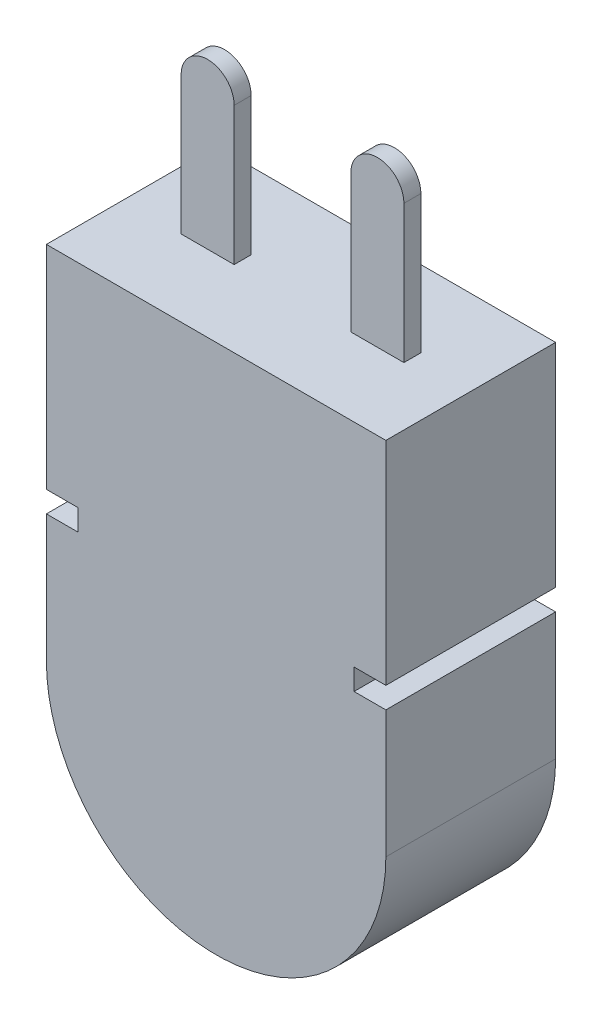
ISO-10303-21;
HEADER;
FILE_DESCRIPTION(('STEP AP214'),'2;1');
FILE_NAME('part.step','',(''),(''),'','','');
FILE_SCHEMA(('AUTOMOTIVE_DESIGN { 1 0 10303 214 1 1 1 1 }'));
ENDSEC;
DATA;
#1=APPLICATION_CONTEXT('core data for automotive mechanical design processes');
#2=APPLICATION_PROTOCOL_DEFINITION('international standard','automotive_design',2000,#1);
#3=PRODUCT_CONTEXT('',#1,'mechanical');
#4=PRODUCT('Part','Part','',(#3));
#5=PRODUCT_RELATED_PRODUCT_CATEGORY('part','',(#4));
#6=PRODUCT_DEFINITION_FORMATION('','',#4);
#7=PRODUCT_DEFINITION_CONTEXT('part definition',#1,'design');
#8=PRODUCT_DEFINITION('design','',#6,#7);
#9=PRODUCT_DEFINITION_SHAPE('','',#8);
#10=(LENGTH_UNIT() NAMED_UNIT(*) SI_UNIT(.MILLI.,.METRE.));
#11=(NAMED_UNIT(*) PLANE_ANGLE_UNIT() SI_UNIT($,.RADIAN.));
#12=(NAMED_UNIT(*) SI_UNIT($,.STERADIAN.) SOLID_ANGLE_UNIT());
#13=UNCERTAINTY_MEASURE_WITH_UNIT(LENGTH_MEASURE(1.E-05),#10,'distance_accuracy_value','');
#14=(GEOMETRIC_REPRESENTATION_CONTEXT(3) GLOBAL_UNCERTAINTY_ASSIGNED_CONTEXT((#13)) GLOBAL_UNIT_ASSIGNED_CONTEXT((#10,
#11,#12)) REPRESENTATION_CONTEXT('',''));
#15=CARTESIAN_POINT('',(0.,0.,0.));
#16=DIRECTION('',(0.,0.,1.));
#17=DIRECTION('',(1.,0.,0.));
#18=AXIS2_PLACEMENT_3D('',#15,#16,#17);
#19=CARTESIAN_POINT('',(-8.,0.,4.));
#20=DIRECTION('',(0.,-1.,0.));
#21=DIRECTION('',(0.,0.,-1.));
#22=AXIS2_PLACEMENT_3D('',#19,#20,#21);
#23=PLANE('',#22);
#24=DIRECTION('',(-1.,0.,0.));
#25=VECTOR('',#24,1.);
#26=CARTESIAN_POINT('',(-8.,0.,-4.));
#27=LINE('',#26,#25);
#28=CARTESIAN_POINT('',(8.,0.,-4.));
#29=VERTEX_POINT('',#28);
#30=CARTESIAN_POINT('',(-8.,0.,-4.));
#31=VERTEX_POINT('',#30);
#32=EDGE_CURVE('E215',#29,#31,#27,.T.);
#33=ORIENTED_EDGE('',*,*,#32,.T.);
#34=DIRECTION('',(0.,0.,-1.));
#35=VECTOR('',#34,1.);
#36=CARTESIAN_POINT('',(-8.,0.,4.));
#37=LINE('',#36,#35);
#38=CARTESIAN_POINT('',(-8.,0.,4.));
#39=VERTEX_POINT('',#38);
#40=EDGE_CURVE('E58',#39,#31,#37,.T.);
#41=ORIENTED_EDGE('',*,*,#40,.F.);
#42=DIRECTION('',(-1.,0.,0.));
#43=VECTOR('',#42,1.);
#44=CARTESIAN_POINT('',(-8.,0.,4.));
#45=LINE('',#44,#43);
#46=CARTESIAN_POINT('',(8.,0.,4.));
#47=VERTEX_POINT('',#46);
#48=EDGE_CURVE('E265',#47,#39,#45,.T.);
#49=ORIENTED_EDGE('',*,*,#48,.F.);
#50=DIRECTION('',(0.,0.,-1.));
#51=VECTOR('',#50,1.);
#52=CARTESIAN_POINT('',(8.,0.,4.));
#53=LINE('',#52,#51);
#54=EDGE_CURVE('E11',#47,#29,#53,.T.);
#55=ORIENTED_EDGE('',*,*,#54,.T.);
#56=EDGE_LOOP('',(#33,#41,#49,#55));
#57=FACE_BOUND('',#56,.T.);
#58=DIRECTION('',(0.,0.,-1.));
#59=VECTOR('',#58,1.);
#60=CARTESIAN_POINT('',(5.25,0.,0.4));
#61=LINE('',#60,#59);
#62=CARTESIAN_POINT('',(5.25,0.,0.4));
#63=VERTEX_POINT('',#62);
#64=CARTESIAN_POINT('',(5.25,0.,-0.4));
#65=VERTEX_POINT('',#64);
#66=EDGE_CURVE('E73',#63,#65,#61,.T.);
#67=ORIENTED_EDGE('',*,*,#66,.F.);
#68=DIRECTION('',(1.,0.,0.));
#69=VECTOR('',#68,1.);
#70=CARTESIAN_POINT('',(5.25,0.,0.4));
#71=LINE('',#70,#69);
#72=CARTESIAN_POINT('',(2.75,0.,0.4));
#73=VERTEX_POINT('',#72);
#74=EDGE_CURVE('E240',#73,#63,#71,.T.);
#75=ORIENTED_EDGE('',*,*,#74,.F.);
#76=DIRECTION('',(0.,0.,-1.));
#77=VECTOR('',#76,1.);
#78=CARTESIAN_POINT('',(2.75,0.,0.4));
#79=LINE('',#78,#77);
#80=CARTESIAN_POINT('',(2.75,0.,-0.4));
#81=VERTEX_POINT('',#80);
#82=EDGE_CURVE('E231',#73,#81,#79,.T.);
#83=ORIENTED_EDGE('',*,*,#82,.T.);
#84=DIRECTION('',(1.,0.,0.));
#85=VECTOR('',#84,1.);
#86=CARTESIAN_POINT('',(5.25,0.,-0.4));
#87=LINE('',#86,#85);
#88=EDGE_CURVE('E246',#81,#65,#87,.T.);
#89=ORIENTED_EDGE('',*,*,#88,.T.);
#90=EDGE_LOOP('',(#67,#75,#83,#89));
#91=FACE_BOUND('',#90,.T.);
#92=DIRECTION('',(1.,0.,0.));
#93=VECTOR('',#92,1.);
#94=CARTESIAN_POINT('',(-5.25,0.,0.4));
#95=LINE('',#94,#93);
#96=CARTESIAN_POINT('',(-5.25,0.,0.4));
#97=VERTEX_POINT('',#96);
#98=CARTESIAN_POINT('',(-2.75,0.,0.4));
#99=VERTEX_POINT('',#98);
#100=EDGE_CURVE('E194',#97,#99,#95,.T.);
#101=ORIENTED_EDGE('',*,*,#100,.F.);
#102=DIRECTION('',(0.,0.,-1.));
#103=VECTOR('',#102,1.);
#104=CARTESIAN_POINT('',(-5.25,0.,0.4));
#105=LINE('',#104,#103);
#106=CARTESIAN_POINT('',(-5.25,0.,-0.4));
#107=VERTEX_POINT('',#106);
#108=EDGE_CURVE('E636',#97,#107,#105,.T.);
#109=ORIENTED_EDGE('',*,*,#108,.T.);
#110=DIRECTION('',(1.,0.,0.));
#111=VECTOR('',#110,1.);
#112=CARTESIAN_POINT('',(-5.25,0.,-0.4));
#113=LINE('',#112,#111);
#114=CARTESIAN_POINT('',(-2.75,0.,-0.4));
#115=VERTEX_POINT('',#114);
#116=EDGE_CURVE('E208',#107,#115,#113,.T.);
#117=ORIENTED_EDGE('',*,*,#116,.T.);
#118=DIRECTION('',(0.,0.,-1.));
#119=VECTOR('',#118,1.);
#120=CARTESIAN_POINT('',(-2.75,0.,0.4));
#121=LINE('',#120,#119);
#122=EDGE_CURVE('E65',#99,#115,#121,.T.);
#123=ORIENTED_EDGE('',*,*,#122,.F.);
#124=EDGE_LOOP('',(#101,#109,#117,#123));
#125=FACE_BOUND('',#124,.T.);
#126=ADVANCED_FACE('F49',(#57,#91,#125),#23,.F.);
#127=CARTESIAN_POINT('',(8.,0.,4.));
#128=DIRECTION('',(-1.,0.,0.));
#129=DIRECTION('',(0.,0.,1.));
#130=AXIS2_PLACEMENT_3D('',#127,#128,#129);
#131=PLANE('',#130);
#132=DIRECTION('',(0.,1.,0.));
#133=VECTOR('',#132,1.);
#134=CARTESIAN_POINT('',(8.,0.,-4.));
#135=LINE('',#134,#133);
#136=CARTESIAN_POINT('',(8.,-10.,-4.));
#137=VERTEX_POINT('',#136);
#138=EDGE_CURVE('E210',#137,#29,#135,.T.);
#139=ORIENTED_EDGE('',*,*,#138,.T.);
#140=ORIENTED_EDGE('',*,*,#54,.F.);
#141=DIRECTION('',(0.,1.,0.));
#142=VECTOR('',#141,1.);
#143=CARTESIAN_POINT('',(8.,0.,4.));
#144=LINE('',#143,#142);
#145=CARTESIAN_POINT('',(8.,-10.,4.));
#146=VERTEX_POINT('',#145);
#147=EDGE_CURVE('E261',#146,#47,#144,.T.);
#148=ORIENTED_EDGE('',*,*,#147,.F.);
#149=DIRECTION('',(0.,0.,-1.));
#150=VECTOR('',#149,1.);
#151=CARTESIAN_POINT('',(8.,-10.,4.));
#152=LINE('',#151,#150);
#153=EDGE_CURVE('E298',#146,#137,#152,.T.);
#154=ORIENTED_EDGE('',*,*,#153,.T.);
#155=EDGE_LOOP('',(#139,#140,#148,#154));
#156=FACE_BOUND('',#155,.T.);
#157=ADVANCED_FACE('F51',(#156),#131,.F.);
#158=CARTESIAN_POINT('',(-8.,-10.,4.));
#159=DIRECTION('',(1.,0.,0.));
#160=DIRECTION('',(0.,0.,-1.));
#161=AXIS2_PLACEMENT_3D('',#158,#159,#160);
#162=PLANE('',#161);
#163=DIRECTION('',(0.,-1.,0.));
#164=VECTOR('',#163,1.);
#165=CARTESIAN_POINT('',(-8.,-10.,-4.));
#166=LINE('',#165,#164);
#167=CARTESIAN_POINT('',(-8.,-10.,-4.));
#168=VERTEX_POINT('',#167);
#169=EDGE_CURVE('E302',#31,#168,#166,.T.);
#170=ORIENTED_EDGE('',*,*,#169,.T.);
#171=DIRECTION('',(0.,0.,-1.));
#172=VECTOR('',#171,1.);
#173=CARTESIAN_POINT('',(-8.,-10.,4.));
#174=LINE('',#173,#172);
#175=CARTESIAN_POINT('',(-8.,-10.,4.));
#176=VERTEX_POINT('',#175);
#177=EDGE_CURVE('E366',#176,#168,#174,.T.);
#178=ORIENTED_EDGE('',*,*,#177,.F.);
#179=DIRECTION('',(0.,-1.,0.));
#180=VECTOR('',#179,1.);
#181=CARTESIAN_POINT('',(-8.,-10.,4.));
#182=LINE('',#181,#180);
#183=EDGE_CURVE('E269',#39,#176,#182,.T.);
#184=ORIENTED_EDGE('',*,*,#183,.F.);
#185=ORIENTED_EDGE('',*,*,#40,.T.);
#186=EDGE_LOOP('',(#170,#178,#184,#185));
#187=FACE_BOUND('',#186,.T.);
#188=ADVANCED_FACE('F375',(#187),#162,.F.);
#189=CARTESIAN_POINT('',(-6.5,-10.,4.));
#190=DIRECTION('',(0.,1.,0.));
#191=DIRECTION('',(0.,0.,1.));
#192=AXIS2_PLACEMENT_3D('',#189,#190,#191);
#193=PLANE('',#192);
#194=DIRECTION('',(1.,0.,0.));
#195=VECTOR('',#194,1.);
#196=CARTESIAN_POINT('',(-6.5,-10.,-4.));
#197=LINE('',#196,#195);
#198=CARTESIAN_POINT('',(-6.5,-10.,-4.));
#199=VERTEX_POINT('',#198);
#200=EDGE_CURVE('E305',#168,#199,#197,.T.);
#201=ORIENTED_EDGE('',*,*,#200,.T.);
#202=DIRECTION('',(0.,0.,-1.));
#203=VECTOR('',#202,1.);
#204=CARTESIAN_POINT('',(-6.5,-10.,4.));
#205=LINE('',#204,#203);
#206=CARTESIAN_POINT('',(-6.5,-10.,4.));
#207=VERTEX_POINT('',#206);
#208=EDGE_CURVE('E362',#207,#199,#205,.T.);
#209=ORIENTED_EDGE('',*,*,#208,.F.);
#210=DIRECTION('',(1.,0.,0.));
#211=VECTOR('',#210,1.);
#212=CARTESIAN_POINT('',(-6.5,-10.,4.));
#213=LINE('',#212,#211);
#214=EDGE_CURVE('E272',#176,#207,#213,.T.);
#215=ORIENTED_EDGE('',*,*,#214,.F.);
#216=ORIENTED_EDGE('',*,*,#177,.T.);
#217=EDGE_LOOP('',(#201,#209,#215,#216));
#218=FACE_BOUND('',#217,.T.);
#219=ADVANCED_FACE('F386',(#218),#193,.F.);
#220=CARTESIAN_POINT('',(-6.5,-11.,4.));
#221=DIRECTION('',(1.,0.,0.));
#222=DIRECTION('',(0.,1.,0.));
#223=AXIS2_PLACEMENT_3D('',#220,#221,#222);
#224=PLANE('',#223);
#225=DIRECTION('',(0.,-1.,0.));
#226=VECTOR('',#225,1.);
#227=CARTESIAN_POINT('',(-6.5,-11.,-4.));
#228=LINE('',#227,#226);
#229=CARTESIAN_POINT('',(-6.5,-11.,-4.));
#230=VERTEX_POINT('',#229);
#231=EDGE_CURVE('E308',#199,#230,#228,.T.);
#232=ORIENTED_EDGE('',*,*,#231,.T.);
#233=DIRECTION('',(0.,0.,-1.));
#234=VECTOR('',#233,1.);
#235=CARTESIAN_POINT('',(-6.5,-11.,4.));
#236=LINE('',#235,#234);
#237=CARTESIAN_POINT('',(-6.5,-11.,4.));
#238=VERTEX_POINT('',#237);
#239=EDGE_CURVE('E358',#238,#230,#236,.T.);
#240=ORIENTED_EDGE('',*,*,#239,.F.);
#241=DIRECTION('',(0.,-1.,0.));
#242=VECTOR('',#241,1.);
#243=CARTESIAN_POINT('',(-6.5,-11.,4.));
#244=LINE('',#243,#242);
#245=EDGE_CURVE('E275',#207,#238,#244,.T.);
#246=ORIENTED_EDGE('',*,*,#245,.F.);
#247=ORIENTED_EDGE('',*,*,#208,.T.);
#248=EDGE_LOOP('',(#232,#240,#246,#247));
#249=FACE_BOUND('',#248,.T.);
#250=ADVANCED_FACE('F390',(#249),#224,.F.);
#251=CARTESIAN_POINT('',(-8.,-11.,4.));
#252=DIRECTION('',(0.,-1.,0.));
#253=DIRECTION('',(0.,0.,-1.));
#254=AXIS2_PLACEMENT_3D('',#251,#252,#253);
#255=PLANE('',#254);
#256=DIRECTION('',(-1.,0.,0.));
#257=VECTOR('',#256,1.);
#258=CARTESIAN_POINT('',(-8.,-11.,-4.));
#259=LINE('',#258,#257);
#260=CARTESIAN_POINT('',(-8.,-11.,-4.));
#261=VERTEX_POINT('',#260);
#262=EDGE_CURVE('E311',#230,#261,#259,.T.);
#263=ORIENTED_EDGE('',*,*,#262,.T.);
#264=DIRECTION('',(0.,0.,-1.));
#265=VECTOR('',#264,1.);
#266=CARTESIAN_POINT('',(-8.,-11.,4.));
#267=LINE('',#266,#265);
#268=CARTESIAN_POINT('',(-8.,-11.,4.));
#269=VERTEX_POINT('',#268);
#270=EDGE_CURVE('E354',#269,#261,#267,.T.);
#271=ORIENTED_EDGE('',*,*,#270,.F.);
#272=DIRECTION('',(-1.,0.,0.));
#273=VECTOR('',#272,1.);
#274=CARTESIAN_POINT('',(-8.,-11.,4.));
#275=LINE('',#274,#273);
#276=EDGE_CURVE('E278',#238,#269,#275,.T.);
#277=ORIENTED_EDGE('',*,*,#276,.F.);
#278=ORIENTED_EDGE('',*,*,#239,.T.);
#279=EDGE_LOOP('',(#263,#271,#277,#278));
#280=FACE_BOUND('',#279,.T.);
#281=ADVANCED_FACE('F430',(#280),#255,.F.);
#282=CARTESIAN_POINT('',(-8.,-17.,4.));
#283=DIRECTION('',(1.,0.,0.));
#284=DIRECTION('',(0.,1.,0.));
#285=AXIS2_PLACEMENT_3D('',#282,#283,#284);
#286=PLANE('',#285);
#287=DIRECTION('',(0.,-1.,0.));
#288=VECTOR('',#287,1.);
#289=CARTESIAN_POINT('',(-8.,-17.,-4.));
#290=LINE('',#289,#288);
#291=CARTESIAN_POINT('',(-8.,-17.,-4.));
#292=VERTEX_POINT('',#291);
#293=EDGE_CURVE('E314',#261,#292,#290,.T.);
#294=ORIENTED_EDGE('',*,*,#293,.T.);
#295=DIRECTION('',(0.,0.,-1.));
#296=VECTOR('',#295,1.);
#297=CARTESIAN_POINT('',(-8.,-17.,4.));
#298=LINE('',#297,#296);
#299=CARTESIAN_POINT('',(-8.,-17.,4.));
#300=VERTEX_POINT('',#299);
#301=EDGE_CURVE('E350',#300,#292,#298,.T.);
#302=ORIENTED_EDGE('',*,*,#301,.F.);
#303=DIRECTION('',(0.,-1.,0.));
#304=VECTOR('',#303,1.);
#305=CARTESIAN_POINT('',(-8.,-17.,4.));
#306=LINE('',#305,#304);
#307=EDGE_CURVE('E281',#269,#300,#306,.T.);
#308=ORIENTED_EDGE('',*,*,#307,.F.);
#309=ORIENTED_EDGE('',*,*,#270,.T.);
#310=EDGE_LOOP('',(#294,#302,#308,#309));
#311=FACE_BOUND('',#310,.T.);
#312=ADVANCED_FACE('F428',(#311),#286,.F.);
#313=CARTESIAN_POINT('',(0.,-17.,4.));
#314=DIRECTION('',(0.,0.,-1.));
#315=DIRECTION('',(-1.,0.,0.));
#316=AXIS2_PLACEMENT_3D('',#313,#314,#315);
#317=CYLINDRICAL_SURFACE('',#316,8.);
#318=CARTESIAN_POINT('',(0.,-17.,-4.));
#319=DIRECTION('',(0.,0.,1.));
#320=DIRECTION('',(-1.,0.,0.));
#321=AXIS2_PLACEMENT_3D('',#318,#319,#320);
#322=CIRCLE('',#321,8.);
#323=CARTESIAN_POINT('',(8.,-17.,-4.));
#324=VERTEX_POINT('',#323);
#325=EDGE_CURVE('E317',#292,#324,#322,.T.);
#326=ORIENTED_EDGE('',*,*,#325,.T.);
#327=DIRECTION('',(0.,0.,-1.));
#328=VECTOR('',#327,1.);
#329=CARTESIAN_POINT('',(8.,-17.,4.));
#330=LINE('',#329,#328);
#331=CARTESIAN_POINT('',(8.,-17.,4.));
#332=VERTEX_POINT('',#331);
#333=EDGE_CURVE('E346',#332,#324,#330,.T.);
#334=ORIENTED_EDGE('',*,*,#333,.F.);
#335=CARTESIAN_POINT('',(0.,-17.,4.));
#336=DIRECTION('',(0.,0.,1.));
#337=DIRECTION('',(-1.,0.,0.));
#338=AXIS2_PLACEMENT_3D('',#335,#336,#337);
#339=CIRCLE('',#338,8.);
#340=EDGE_CURVE('E284',#300,#332,#339,.T.);
#341=ORIENTED_EDGE('',*,*,#340,.F.);
#342=ORIENTED_EDGE('',*,*,#301,.T.);
#343=EDGE_LOOP('',(#326,#334,#341,#342));
#344=FACE_BOUND('',#343,.T.);
#345=ADVANCED_FACE('F424',(#344),#317,.T.);
#346=CARTESIAN_POINT('',(8.,-11.,4.));
#347=DIRECTION('',(-1.,0.,0.));
#348=DIRECTION('',(0.,-1.,0.));
#349=AXIS2_PLACEMENT_3D('',#346,#347,#348);
#350=PLANE('',#349);
#351=DIRECTION('',(0.,1.,0.));
#352=VECTOR('',#351,1.);
#353=CARTESIAN_POINT('',(8.,-11.,-4.));
#354=LINE('',#353,#352);
#355=CARTESIAN_POINT('',(8.,-11.,-4.));
#356=VERTEX_POINT('',#355);
#357=EDGE_CURVE('E320',#324,#356,#354,.T.);
#358=ORIENTED_EDGE('',*,*,#357,.T.);
#359=DIRECTION('',(0.,0.,-1.));
#360=VECTOR('',#359,1.);
#361=CARTESIAN_POINT('',(8.,-11.,4.));
#362=LINE('',#361,#360);
#363=CARTESIAN_POINT('',(8.,-11.,4.));
#364=VERTEX_POINT('',#363);
#365=EDGE_CURVE('E342',#364,#356,#362,.T.);
#366=ORIENTED_EDGE('',*,*,#365,.F.);
#367=DIRECTION('',(0.,1.,0.));
#368=VECTOR('',#367,1.);
#369=CARTESIAN_POINT('',(8.,-11.,4.));
#370=LINE('',#369,#368);
#371=EDGE_CURVE('E287',#332,#364,#370,.T.);
#372=ORIENTED_EDGE('',*,*,#371,.F.);
#373=ORIENTED_EDGE('',*,*,#333,.T.);
#374=EDGE_LOOP('',(#358,#366,#372,#373));
#375=FACE_BOUND('',#374,.T.);
#376=ADVANCED_FACE('F419',(#375),#350,.F.);
#377=CARTESIAN_POINT('',(6.5,-11.,4.));
#378=DIRECTION('',(0.,-1.,0.));
#379=DIRECTION('',(0.,0.,-1.));
#380=AXIS2_PLACEMENT_3D('',#377,#378,#379);
#381=PLANE('',#380);
#382=DIRECTION('',(-1.,0.,0.));
#383=VECTOR('',#382,1.);
#384=CARTESIAN_POINT('',(6.5,-11.,-4.));
#385=LINE('',#384,#383);
#386=CARTESIAN_POINT('',(6.5,-11.,-4.));
#387=VERTEX_POINT('',#386);
#388=EDGE_CURVE('E323',#356,#387,#385,.T.);
#389=ORIENTED_EDGE('',*,*,#388,.T.);
#390=DIRECTION('',(0.,0.,-1.));
#391=VECTOR('',#390,1.);
#392=CARTESIAN_POINT('',(6.5,-11.,4.));
#393=LINE('',#392,#391);
#394=CARTESIAN_POINT('',(6.5,-11.,4.));
#395=VERTEX_POINT('',#394);
#396=EDGE_CURVE('E338',#395,#387,#393,.T.);
#397=ORIENTED_EDGE('',*,*,#396,.F.);
#398=DIRECTION('',(-1.,0.,0.));
#399=VECTOR('',#398,1.);
#400=CARTESIAN_POINT('',(6.5,-11.,4.));
#401=LINE('',#400,#399);
#402=EDGE_CURVE('E290',#364,#395,#401,.T.);
#403=ORIENTED_EDGE('',*,*,#402,.F.);
#404=ORIENTED_EDGE('',*,*,#365,.T.);
#405=EDGE_LOOP('',(#389,#397,#403,#404));
#406=FACE_BOUND('',#405,.T.);
#407=ADVANCED_FACE('F413',(#406),#381,.F.);
#408=CARTESIAN_POINT('',(6.5,-10.,4.));
#409=DIRECTION('',(-1.,0.,0.));
#410=DIRECTION('',(0.,-1.,0.));
#411=AXIS2_PLACEMENT_3D('',#408,#409,#410);
#412=PLANE('',#411);
#413=DIRECTION('',(0.,1.,0.));
#414=VECTOR('',#413,1.);
#415=CARTESIAN_POINT('',(6.5,-10.,-4.));
#416=LINE('',#415,#414);
#417=CARTESIAN_POINT('',(6.5,-10.,-4.));
#418=VERTEX_POINT('',#417);
#419=EDGE_CURVE('E326',#387,#418,#416,.T.);
#420=ORIENTED_EDGE('',*,*,#419,.T.);
#421=DIRECTION('',(0.,0.,-1.));
#422=VECTOR('',#421,1.);
#423=CARTESIAN_POINT('',(6.5,-10.,4.));
#424=LINE('',#423,#422);
#425=CARTESIAN_POINT('',(6.5,-10.,4.));
#426=VERTEX_POINT('',#425);
#427=EDGE_CURVE('E334',#426,#418,#424,.T.);
#428=ORIENTED_EDGE('',*,*,#427,.F.);
#429=DIRECTION('',(0.,1.,0.));
#430=VECTOR('',#429,1.);
#431=CARTESIAN_POINT('',(6.5,-10.,4.));
#432=LINE('',#431,#430);
#433=EDGE_CURVE('E293',#395,#426,#432,.T.);
#434=ORIENTED_EDGE('',*,*,#433,.F.);
#435=ORIENTED_EDGE('',*,*,#396,.T.);
#436=EDGE_LOOP('',(#420,#428,#434,#435));
#437=FACE_BOUND('',#436,.T.);
#438=ADVANCED_FACE('F409',(#437),#412,.F.);
#439=CARTESIAN_POINT('',(8.,-10.,4.));
#440=DIRECTION('',(0.,1.,0.));
#441=DIRECTION('',(-1.,0.,0.));
#442=AXIS2_PLACEMENT_3D('',#439,#440,#441);
#443=PLANE('',#442);
#444=DIRECTION('',(1.,0.,0.));
#445=VECTOR('',#444,1.);
#446=CARTESIAN_POINT('',(8.,-10.,-4.));
#447=LINE('',#446,#445);
#448=EDGE_CURVE('E266',#418,#137,#447,.T.);
#449=ORIENTED_EDGE('',*,*,#448,.T.);
#450=ORIENTED_EDGE('',*,*,#153,.F.);
#451=DIRECTION('',(1.,0.,0.));
#452=VECTOR('',#451,1.);
#453=CARTESIAN_POINT('',(8.,-10.,4.));
#454=LINE('',#453,#452);
#455=EDGE_CURVE('E296',#426,#146,#454,.T.);
#456=ORIENTED_EDGE('',*,*,#455,.F.);
#457=ORIENTED_EDGE('',*,*,#427,.T.);
#458=EDGE_LOOP('',(#449,#450,#456,#457));
#459=FACE_BOUND('',#458,.T.);
#460=ADVANCED_FACE('F404',(#459),#443,.F.);
#461=CARTESIAN_POINT('',(0.,-17.,4.));
#462=DIRECTION('',(0.,0.,-1.));
#463=DIRECTION('',(-1.,0.,0.));
#464=AXIS2_PLACEMENT_3D('',#461,#462,#463);
#465=PLANE('',#464);
#466=ORIENTED_EDGE('',*,*,#147,.T.);
#467=ORIENTED_EDGE('',*,*,#48,.T.);
#468=ORIENTED_EDGE('',*,*,#183,.T.);
#469=ORIENTED_EDGE('',*,*,#214,.T.);
#470=ORIENTED_EDGE('',*,*,#245,.T.);
#471=ORIENTED_EDGE('',*,*,#276,.T.);
#472=ORIENTED_EDGE('',*,*,#307,.T.);
#473=ORIENTED_EDGE('',*,*,#340,.T.);
#474=ORIENTED_EDGE('',*,*,#371,.T.);
#475=ORIENTED_EDGE('',*,*,#402,.T.);
#476=ORIENTED_EDGE('',*,*,#433,.T.);
#477=ORIENTED_EDGE('',*,*,#455,.T.);
#478=EDGE_LOOP('',(#466,#467,#468,#469,#470,#471,#472,#473,#474,#475,#476,#477));
#479=FACE_BOUND('',#478,.T.);
#480=ADVANCED_FACE('F394',(#479),#465,.F.);
#481=CARTESIAN_POINT('',(0.,-17.,-4.));
#482=DIRECTION('',(0.,0.,-1.));
#483=DIRECTION('',(-1.,0.,0.));
#484=AXIS2_PLACEMENT_3D('',#481,#482,#483);
#485=PLANE('',#484);
#486=ORIENTED_EDGE('',*,*,#138,.F.);
#487=ORIENTED_EDGE('',*,*,#448,.F.);
#488=ORIENTED_EDGE('',*,*,#419,.F.);
#489=ORIENTED_EDGE('',*,*,#388,.F.);
#490=ORIENTED_EDGE('',*,*,#357,.F.);
#491=ORIENTED_EDGE('',*,*,#325,.F.);
#492=ORIENTED_EDGE('',*,*,#293,.F.);
#493=ORIENTED_EDGE('',*,*,#262,.F.);
#494=ORIENTED_EDGE('',*,*,#231,.F.);
#495=ORIENTED_EDGE('',*,*,#200,.F.);
#496=ORIENTED_EDGE('',*,*,#169,.F.);
#497=ORIENTED_EDGE('',*,*,#32,.F.);
#498=EDGE_LOOP('',(#486,#487,#488,#489,#490,#491,#492,#493,#494,#495,#496,#497));
#499=FACE_BOUND('',#498,.T.);
#500=ADVANCED_FACE('F381',(#499),#485,.T.);
#501=CARTESIAN_POINT('',(5.25,0.,0.4));
#502=DIRECTION('',(-1.,0.,0.));
#503=DIRECTION('',(0.,-1.,0.));
#504=AXIS2_PLACEMENT_3D('',#501,#502,#503);
#505=PLANE('',#504);
#506=DIRECTION('',(0.,1.,0.));
#507=VECTOR('',#506,1.);
#508=CARTESIAN_POINT('',(5.25,0.,-0.4));
#509=LINE('',#508,#507);
#510=CARTESIAN_POINT('',(5.25,6.5,-0.4));
#511=VERTEX_POINT('',#510);
#512=EDGE_CURVE('E243',#65,#511,#509,.T.);
#513=ORIENTED_EDGE('',*,*,#512,.T.);
#514=DIRECTION('',(0.,0.,-1.));
#515=VECTOR('',#514,1.);
#516=CARTESIAN_POINT('',(5.25,6.5,0.4));
#517=LINE('',#516,#515);
#518=CARTESIAN_POINT('',(5.25,6.5,0.4));
#519=VERTEX_POINT('',#518);
#520=EDGE_CURVE('E223',#519,#511,#517,.T.);
#521=ORIENTED_EDGE('',*,*,#520,.F.);
#522=DIRECTION('',(0.,1.,0.));
#523=VECTOR('',#522,1.);
#524=CARTESIAN_POINT('',(5.25,0.,0.4));
#525=LINE('',#524,#523);
#526=EDGE_CURVE('E255',#63,#519,#525,.T.);
#527=ORIENTED_EDGE('',*,*,#526,.F.);
#528=ORIENTED_EDGE('',*,*,#66,.T.);
#529=EDGE_LOOP('',(#513,#521,#527,#528));
#530=FACE_BOUND('',#529,.T.);
#531=ADVANCED_FACE('F521',(#530),#505,.F.);
#532=CARTESIAN_POINT('',(4.,6.5,0.4));
#533=DIRECTION('',(0.,0.,-1.));
#534=DIRECTION('',(-1.,0.,0.));
#535=AXIS2_PLACEMENT_3D('',#532,#533,#534);
#536=CYLINDRICAL_SURFACE('',#535,1.25);
#537=CARTESIAN_POINT('',(4.,6.5,-0.4));
#538=DIRECTION('',(0.,0.,1.));
#539=DIRECTION('',(1.,0.,0.));
#540=AXIS2_PLACEMENT_3D('',#537,#538,#539);
#541=CIRCLE('',#540,1.25);
#542=CARTESIAN_POINT('',(2.75,6.5,-0.4));
#543=VERTEX_POINT('',#542);
#544=EDGE_CURVE('E239',#511,#543,#541,.T.);
#545=ORIENTED_EDGE('',*,*,#544,.T.);
#546=DIRECTION('',(0.,0.,-1.));
#547=VECTOR('',#546,1.);
#548=CARTESIAN_POINT('',(2.75,6.5,0.4));
#549=LINE('',#548,#547);
#550=CARTESIAN_POINT('',(2.75,6.5,0.4));
#551=VERTEX_POINT('',#550);
#552=EDGE_CURVE('E227',#551,#543,#549,.T.);
#553=ORIENTED_EDGE('',*,*,#552,.F.);
#554=CARTESIAN_POINT('',(4.,6.5,0.4));
#555=DIRECTION('',(0.,0.,1.));
#556=DIRECTION('',(1.,0.,0.));
#557=AXIS2_PLACEMENT_3D('',#554,#555,#556);
#558=CIRCLE('',#557,1.25);
#559=EDGE_CURVE('E252',#519,#551,#558,.T.);
#560=ORIENTED_EDGE('',*,*,#559,.F.);
#561=ORIENTED_EDGE('',*,*,#520,.T.);
#562=EDGE_LOOP('',(#545,#553,#560,#561));
#563=FACE_BOUND('',#562,.T.);
#564=ADVANCED_FACE('F541',(#563),#536,.T.);
#565=CARTESIAN_POINT('',(2.75,6.5,0.4));
#566=DIRECTION('',(1.,0.,0.));
#567=DIRECTION('',(0.,1.,0.));
#568=AXIS2_PLACEMENT_3D('',#565,#566,#567);
#569=PLANE('',#568);
#570=DIRECTION('',(0.,-1.,0.));
#571=VECTOR('',#570,1.);
#572=CARTESIAN_POINT('',(2.75,6.5,-0.4));
#573=LINE('',#572,#571);
#574=EDGE_CURVE('E235',#543,#81,#573,.T.);
#575=ORIENTED_EDGE('',*,*,#574,.T.);
#576=ORIENTED_EDGE('',*,*,#82,.F.);
#577=DIRECTION('',(0.,-1.,0.));
#578=VECTOR('',#577,1.);
#579=CARTESIAN_POINT('',(2.75,6.5,0.4));
#580=LINE('',#579,#578);
#581=EDGE_CURVE('E234',#551,#73,#580,.T.);
#582=ORIENTED_EDGE('',*,*,#581,.F.);
#583=ORIENTED_EDGE('',*,*,#552,.T.);
#584=EDGE_LOOP('',(#575,#576,#582,#583));
#585=FACE_BOUND('',#584,.T.);
#586=ADVANCED_FACE('F549',(#585),#569,.F.);
#587=CARTESIAN_POINT('',(4.,6.5,0.4));
#588=DIRECTION('',(0.,0.,1.));
#589=DIRECTION('',(1.,0.,0.));
#590=AXIS2_PLACEMENT_3D('',#587,#588,#589);
#591=PLANE('',#590);
#592=ORIENTED_EDGE('',*,*,#74,.T.);
#593=ORIENTED_EDGE('',*,*,#526,.T.);
#594=ORIENTED_EDGE('',*,*,#559,.T.);
#595=ORIENTED_EDGE('',*,*,#581,.T.);
#596=EDGE_LOOP('',(#592,#593,#594,#595));
#597=FACE_BOUND('',#596,.T.);
#598=ADVANCED_FACE('F558',(#597),#591,.T.);
#599=CARTESIAN_POINT('',(4.,6.5,-0.4));
#600=DIRECTION('',(0.,0.,1.));
#601=DIRECTION('',(1.,0.,0.));
#602=AXIS2_PLACEMENT_3D('',#599,#600,#601);
#603=PLANE('',#602);
#604=ORIENTED_EDGE('',*,*,#88,.F.);
#605=ORIENTED_EDGE('',*,*,#574,.F.);
#606=ORIENTED_EDGE('',*,*,#544,.F.);
#607=ORIENTED_EDGE('',*,*,#512,.F.);
#608=EDGE_LOOP('',(#604,#605,#606,#607));
#609=FACE_BOUND('',#608,.T.);
#610=ADVANCED_FACE('F567',(#609),#603,.F.);
#611=CARTESIAN_POINT('',(-2.75,6.5,0.4));
#612=DIRECTION('',(-1.,0.,0.));
#613=DIRECTION('',(0.,-1.,0.));
#614=AXIS2_PLACEMENT_3D('',#611,#612,#613);
#615=PLANE('',#614);
#616=DIRECTION('',(0.,1.,0.));
#617=VECTOR('',#616,1.);
#618=CARTESIAN_POINT('',(-2.75,6.5,-0.4));
#619=LINE('',#618,#617);
#620=CARTESIAN_POINT('',(-2.75,6.5,-0.4));
#621=VERTEX_POINT('',#620);
#622=EDGE_CURVE('E633',#115,#621,#619,.T.);
#623=ORIENTED_EDGE('',*,*,#622,.T.);
#624=DIRECTION('',(0.,0.,-1.));
#625=VECTOR('',#624,1.);
#626=CARTESIAN_POINT('',(-2.75,6.5,0.4));
#627=LINE('',#626,#625);
#628=CARTESIAN_POINT('',(-2.75,6.5,0.4));
#629=VERTEX_POINT('',#628);
#630=EDGE_CURVE('E189',#629,#621,#627,.T.);
#631=ORIENTED_EDGE('',*,*,#630,.F.);
#632=DIRECTION('',(0.,1.,0.));
#633=VECTOR('',#632,1.);
#634=CARTESIAN_POINT('',(-2.75,6.5,0.4));
#635=LINE('',#634,#633);
#636=EDGE_CURVE('E185',#99,#629,#635,.T.);
#637=ORIENTED_EDGE('',*,*,#636,.F.);
#638=ORIENTED_EDGE('',*,*,#122,.T.);
#639=EDGE_LOOP('',(#623,#631,#637,#638));
#640=FACE_BOUND('',#639,.T.);
#641=ADVANCED_FACE('F187',(#640),#615,.F.);
#642=CARTESIAN_POINT('',(-4.,6.5,0.4));
#643=DIRECTION('',(0.,0.,-1.));
#644=DIRECTION('',(-1.,0.,0.));
#645=AXIS2_PLACEMENT_3D('',#642,#643,#644);
#646=CYLINDRICAL_SURFACE('',#645,1.25);
#647=CARTESIAN_POINT('',(-4.,6.5,-0.4));
#648=DIRECTION('',(0.,0.,1.));
#649=DIRECTION('',(-1.,0.,0.));
#650=AXIS2_PLACEMENT_3D('',#647,#648,#649);
#651=CIRCLE('',#650,1.25);
#652=CARTESIAN_POINT('',(-5.25,6.5,-0.4));
#653=VERTEX_POINT('',#652);
#654=EDGE_CURVE('E646',#621,#653,#651,.T.);
#655=ORIENTED_EDGE('',*,*,#654,.T.);
#656=DIRECTION('',(0.,0.,-1.));
#657=VECTOR('',#656,1.);
#658=CARTESIAN_POINT('',(-5.25,6.5,0.4));
#659=LINE('',#658,#657);
#660=CARTESIAN_POINT('',(-5.25,6.5,0.4));
#661=VERTEX_POINT('',#660);
#662=EDGE_CURVE('E217',#661,#653,#659,.T.);
#663=ORIENTED_EDGE('',*,*,#662,.F.);
#664=CARTESIAN_POINT('',(-4.,6.5,0.4));
#665=DIRECTION('',(0.,0.,1.));
#666=DIRECTION('',(-1.,0.,0.));
#667=AXIS2_PLACEMENT_3D('',#664,#665,#666);
#668=CIRCLE('',#667,1.25);
#669=EDGE_CURVE('E193',#629,#661,#668,.T.);
#670=ORIENTED_EDGE('',*,*,#669,.F.);
#671=ORIENTED_EDGE('',*,*,#630,.T.);
#672=EDGE_LOOP('',(#655,#663,#670,#671));
#673=FACE_BOUND('',#672,.T.);
#674=ADVANCED_FACE('F584',(#673),#646,.T.);
#675=CARTESIAN_POINT('',(-5.25,0.,0.4));
#676=DIRECTION('',(1.,0.,0.));
#677=DIRECTION('',(0.,1.,0.));
#678=AXIS2_PLACEMENT_3D('',#675,#676,#677);
#679=PLANE('',#678);
#680=DIRECTION('',(0.,-1.,0.));
#681=VECTOR('',#680,1.);
#682=CARTESIAN_POINT('',(-5.25,0.,-0.4));
#683=LINE('',#682,#681);
#684=EDGE_CURVE('E204',#653,#107,#683,.T.);
#685=ORIENTED_EDGE('',*,*,#684,.T.);
#686=ORIENTED_EDGE('',*,*,#108,.F.);
#687=DIRECTION('',(0.,-1.,0.));
#688=VECTOR('',#687,1.);
#689=CARTESIAN_POINT('',(-5.25,0.,0.4));
#690=LINE('',#689,#688);
#691=EDGE_CURVE('E199',#661,#97,#690,.T.);
#692=ORIENTED_EDGE('',*,*,#691,.F.);
#693=ORIENTED_EDGE('',*,*,#662,.T.);
#694=EDGE_LOOP('',(#685,#686,#692,#693));
#695=FACE_BOUND('',#694,.T.);
#696=ADVANCED_FACE('F592',(#695),#679,.F.);
#697=CARTESIAN_POINT('',(-4.,6.5,0.4));
#698=DIRECTION('',(0.,0.,-1.));
#699=DIRECTION('',(-1.,0.,0.));
#700=AXIS2_PLACEMENT_3D('',#697,#698,#699);
#701=PLANE('',#700);
#702=ORIENTED_EDGE('',*,*,#100,.T.);
#703=ORIENTED_EDGE('',*,*,#636,.T.);
#704=ORIENTED_EDGE('',*,*,#669,.T.);
#705=ORIENTED_EDGE('',*,*,#691,.T.);
#706=EDGE_LOOP('',(#702,#703,#704,#705));
#707=FACE_BOUND('',#706,.T.);
#708=ADVANCED_FACE('F197',(#707),#701,.F.);
#709=CARTESIAN_POINT('',(-4.,6.5,-0.4));
#710=DIRECTION('',(0.,0.,-1.));
#711=DIRECTION('',(-1.,0.,0.));
#712=AXIS2_PLACEMENT_3D('',#709,#710,#711);
#713=PLANE('',#712);
#714=ORIENTED_EDGE('',*,*,#116,.F.);
#715=ORIENTED_EDGE('',*,*,#684,.F.);
#716=ORIENTED_EDGE('',*,*,#654,.F.);
#717=ORIENTED_EDGE('',*,*,#622,.F.);
#718=EDGE_LOOP('',(#714,#715,#716,#717));
#719=FACE_BOUND('',#718,.T.);
#720=ADVANCED_FACE('F609',(#719),#713,.T.);
#721=CLOSED_SHELL('',(#126,#157,#188,#219,#250,#281,#312,#345,#376,#407,#438,#460,#480,#500,
#531,#564,#586,#598,#610,#641,#674,#696,#708,#720));
#722=MANIFOLD_SOLID_BREP('B2',#721);
#723=ADVANCED_BREP_SHAPE_REPRESENTATION('',(#18,#722),#14);
#724=SHAPE_DEFINITION_REPRESENTATION(#9,#723);
ENDSEC;
END-ISO-10303-21;
